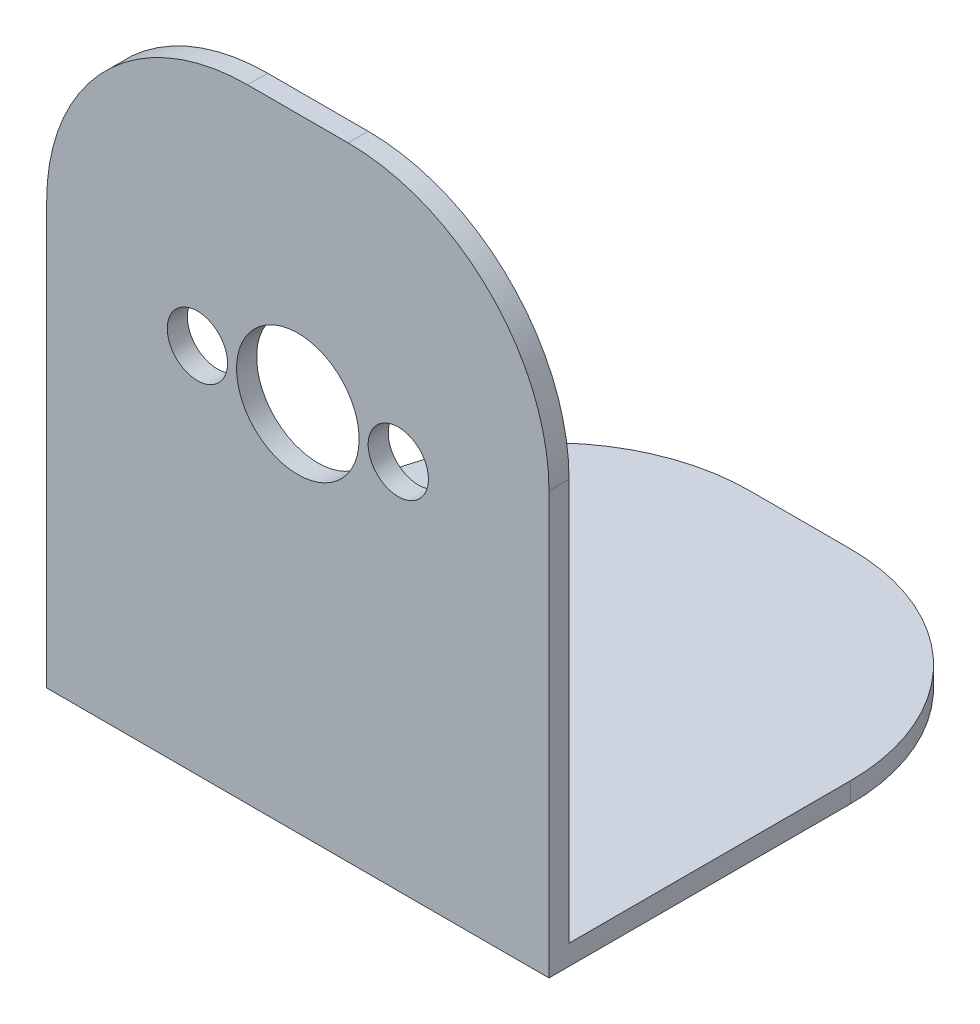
from build123d import *

# Parameters (mm, degrees)
SKETCH1_W      = 25
SKETCH1_H      = 30
SKETCH1_R      = 3.05
SKETCH1_R_2    = 1.5
EXTRUDE1_DEPTH = 1
SKETCH2_W      = 25
SKETCH2_H      = 25
EXTRUDE2_DEPTH = 1
FILLET1_R      = 10


with BuildPart() as part:
    # Sketch1 → Extrude1 (new body)
    with BuildSketch(Plane.XY):
        with Locations((12.5, 15)):
            Rectangle(SKETCH1_W, SKETCH1_H)
        with Locations((12.5, 17.5)):
            Circle(SKETCH1_R, mode=Mode.SUBTRACT)
        with Locations((17.5, 17.5)):
            Circle(SKETCH1_R_2, mode=Mode.SUBTRACT)
        with Locations((7.5, 17.5)):
            Circle(SKETCH1_R_2, mode=Mode.SUBTRACT)
    extrude(amount=EXTRUDE1_DEPTH)

    # Sketch2 → Extrude2 (add)
    with BuildSketch(Plane.XZ):
        with Locations((12.5, -11.5)):
            Rectangle(SKETCH2_W, SKETCH2_H)
    extrude(amount=EXTRUDE2_DEPTH)

    # Fillet1
    fillet1_edges = [part.edges().sort_by_distance(p)[0] for p in [
        (0, -0.5, -24),
        (25, -0.5, -24),
        (0, 30, 0.5),
        (25, 30, 0.5),
    ]]
    fillet(fillet1_edges, radius=FILLET1_R)


solid = part.part
